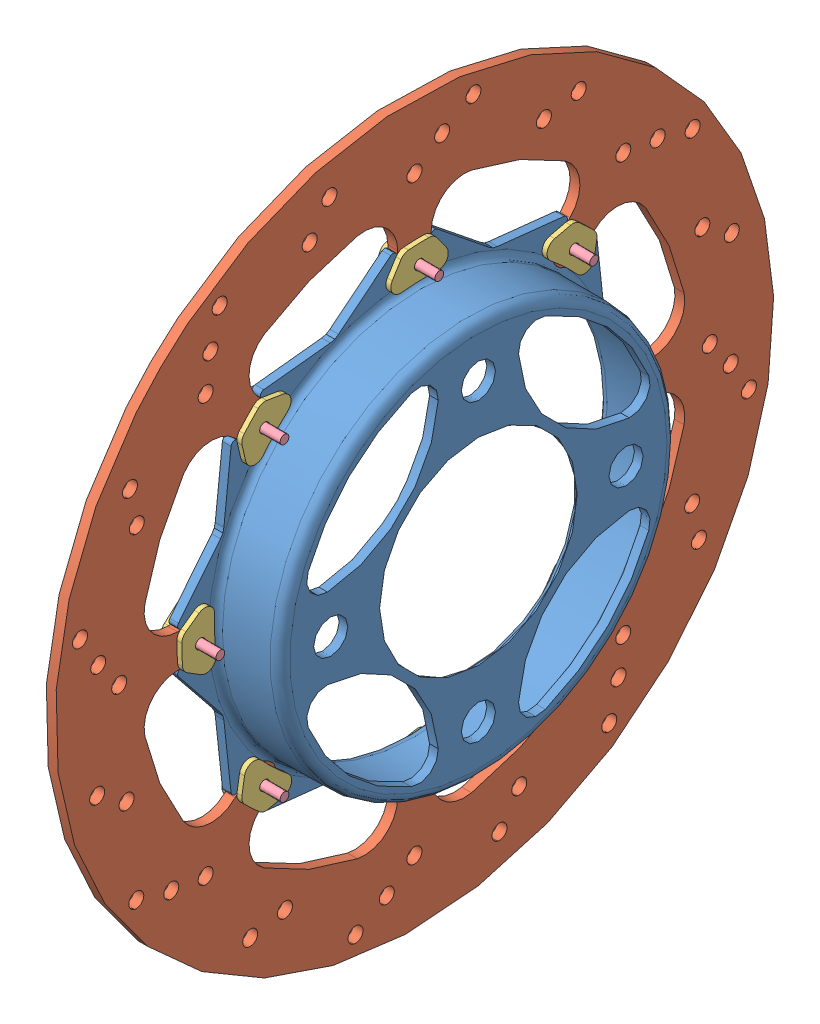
SolidWorks assembly Brake Rotor Assembly.SLDASM, configuration Default (file format 4400). Lengths in mm.
Overall size (25.4 327.78 327.78).
26 component instances, 4 part files, 10 mates.
Components (placement in the parent):
- Rotor Hat-1: Rotor Hat.SLDPRT [Default] at (-34.2242 30.4071 -2.5985) size (23.6 152.4 152.4)
- Rotor - Cast Iron-1: Rotor - Cast Iron.SLDPRT [Default] at (-31.2397 30.4071 -2.5985) x (0 0.707107 0.707107) z (-1 0 0) size (231.78 231.78 3.17)
- Rotor Washer-1: Rotor Washer.SLDPRT [Default] at (-31.2397 33.0101 -12.653) x (0 0.99948 0.032253) z (1 0 0) size (18.57 10.78 1.59)
- Rotor Washer-27: Rotor Washer.SLDPRT [Chamfer] at (-34.4147 41.3596 -11.9484) x (0 -0.990749 -0.135705) z (-1 0 0) size (18.57 10.78 1.59)
- Rotor Pin-6: Rotor Pin.SLDPRT [.5] at (-34.4534 30.4071 68.0135) x (0 0.996402 -0.084747) z (-1 0 0) size (6.36 6.36 12.79)
- Rotor Washer-13: Rotor Washer.SLDPRT [Default] at (-31.2397 25.1381 -11.5488) x (0 0.729545 -0.683933) z (1 0 0) size (18.57 10.78 1.59)
- Rotor Washer-14: Rotor Washer.SLDPRT [Default] at (-31.2397 20.3526 -5.2016) x (0 0.032253 -0.99948) z (1 0 0) size (18.57 10.78 1.59)
- Rotor Washer-15: Rotor Washer.SLDPRT [Default] at (-31.2397 21.4568 2.6705) x (0 -0.683933 -0.729545) z (1 0 0) size (18.57 10.78 1.59)
- Rotor Washer-16: Rotor Washer.SLDPRT [Default] at (-31.2397 27.804 7.456) x (0 -0.99948 -0.032253) z (1 0 0) size (18.57 10.78 1.59)
- Rotor Washer-17: Rotor Washer.SLDPRT [Default] at (-31.2397 35.676 6.3518) x (0 -0.729545 0.683933) z (1 0 0) size (18.57 10.78 1.59)
- Rotor Pin-7: Rotor Pin.SLDPRT [.5] at (-34.4534 80.3373 47.3317) x (0 0.644638 -0.764488) z (-1 0 0) size (6.36 6.36 12.79)
- Rotor Pin-8: Rotor Pin.SLDPRT [.5] at (-34.4534 101.0191 -2.5985) x (0 -0.084747 -0.996402) z (-1 0 0) size (6.36 6.36 12.79)
- Rotor Pin-9: Rotor Pin.SLDPRT [.5] at (-34.4534 80.3373 -52.5287) x (0 -0.764488 -0.644638) z (-1 0 0) size (6.36 6.36 12.79)
- Rotor Pin-10: Rotor Pin.SLDPRT [.5] at (-34.4534 30.4071 -73.2105) x (0 -0.996402 0.084747) z (-1 0 0) size (6.36 6.36 12.79)
- Rotor Pin-11: Rotor Pin.SLDPRT [.5] at (-34.4534 -19.5231 -52.5287) x (0 -0.644638 0.764488) z (-1 0 0) size (6.36 6.36 12.79)
- Rotor Pin-12: Rotor Pin.SLDPRT [.5] at (-34.4534 -40.2049 -2.5985) x (0 0.084747 0.996402) z (-1 0 0) size (6.36 6.36 12.79)
- Rotor Pin-13: Rotor Pin.SLDPRT [.5] at (-34.4534 -19.5231 47.3317) x (0 0.764488 0.644638) z (-1 0 0) size (6.36 6.36 12.79)
- Rotor Washer-25: Rotor Washer.SLDPRT [Default] at (-31.2397 40.4616 0.0046) x (0 -0.032253 0.99948) z (1 0 0) size (18.57 10.78 1.59)
- Rotor Washer-26: Rotor Washer.SLDPRT [Default] at (-31.2397 39.3573 -7.8675) x (0 0.683933 0.729545) z (1 0 0) size (18.57 10.78 1.59)
- Rotor Washer-28: Rotor Washer.SLDPRT [Chamfer] at (-34.4147 31.5403 -16.9545) x (0 -0.796524 0.604608) z (-1 0 0) size (18.57 10.78 1.59)
- Rotor Washer-29: Rotor Washer.SLDPRT [Chamfer] at (-34.4147 21.0572 -13.551) x (0 -0.135705 0.990749) z (-1 0 0) size (18.57 10.78 1.59)
- Rotor Washer-30: Rotor Washer.SLDPRT [Chamfer] at (-34.4147 16.0511 -3.7317) x (0 0.604608 0.796524) z (-1 0 0) size (18.57 10.78 1.59)
- Rotor Washer-31: Rotor Washer.SLDPRT [Chamfer] at (-34.4147 19.4545 6.7514) x (0 0.990749 0.135705) z (-1 0 0) size (18.57 10.78 1.59)
- Rotor Washer-32: Rotor Washer.SLDPRT [Chamfer] at (-34.4147 29.2738 11.7575) x (0 0.796524 -0.604608) z (-1 0 0) size (18.57 10.78 1.59)
- Rotor Washer-33: Rotor Washer.SLDPRT [Chamfer] at (-34.4147 39.757 8.3541) x (0 0.135705 -0.990749) z (-1 0 0) size (18.57 10.78 1.59)
- Rotor Washer-34: Rotor Washer.SLDPRT [Chamfer] at (-34.4147 44.7631 -1.4652) x (0 -0.604608 -0.796524) z (-1 0 0) size (18.57 10.78 1.59)
Mates (geometry in assembly coordinates):
- Coincident1: coincident anti-aligned: plane of Rotor - Cast Iron-1 through (-31.2387 -46.001 2.799) normal (0 0 1); plane of Rotor Hat-1 through (-10.6199 -44.5229 2.799) normal (0 0 -1)
- Distance1: distance = 0.1905 mm aligned: plane of Rotor Hat-1 through (-34.2242 95.5581 -2.5985) normal (-1 0 0); plane of Rotor - Cast Iron-1 through (-34.4147 -149.9716 177.7802) normal (-1 0 0)
- Distance2: distance = 0.1905 mm aligned: plane of Rotor Hat-1 through (-34.2242 95.5581 -2.5985) normal (-1 0 0); plane of Rotor - Cast Iron-1 through (-34.4147 -149.9716 177.7802) normal (-1 0 0)
- Coincident3: coincident anti-aligned: plane of Rotor - Cast Iron-1 through (-31.2397 -149.9716 177.7802) normal (1 0 0); plane of Rotor Washer-1 through (-31.2397 33.4923 70.8481) normal (-1 0 0)
- Concentric4: concentric aligned: cylinder of Rotor Washer-1 through (-29.6522 30.4071 68.0135) axis (-1 0 0) radius 1.5875; cylinder of Rotor - Cast Iron-1 through (-31.2387 30.4071 68.0135) axis (-1 0 0) radius 1.5875
- Coincident5: coincident anti-aligned: plane of Rotor - Cast Iron-1 through (-34.4147 -149.9716 177.7802) normal (-1 0 0); plane of Rotor Washer-27 through (-34.4147 26.8905 70.291) normal (1 0 0)
- Concentric9: concentric anti-aligned: cylinder of Rotor Pin-6 through (-34.4534 30.4071 68.0135) axis (1 0 0) radius 1.4224; cylinder of Rotor - Cast Iron-1 through (-31.2387 30.4071 68.0135) axis (-1 0 0) radius 1.5875
- Coincident6: coincident aligned: cone of Rotor Washer-27 through (-34.0299 30.4071 68.0135) axis (1 0 0); cone of Rotor Pin-6 through (-35.9291 30.4071 68.0135) axis (1 0 0)
- Concentric12: concentric aligned: cylinder of Rotor - Cast Iron-1 through (-34.4147 30.4071 -2.5985) axis (1 0 0) radius 115.8875; circle of Rotor Hat-1
- Concentric13: concentric aligned: cylinder of Rotor - Cast Iron-1 through (-34.4147 30.4071 -2.5985) axis (1 0 0) radius 115.8875; cylinder of Rotor Hat-1 through (-8.3543 30.4071 -2.5985) axis (1 0 0) radius 64.008
